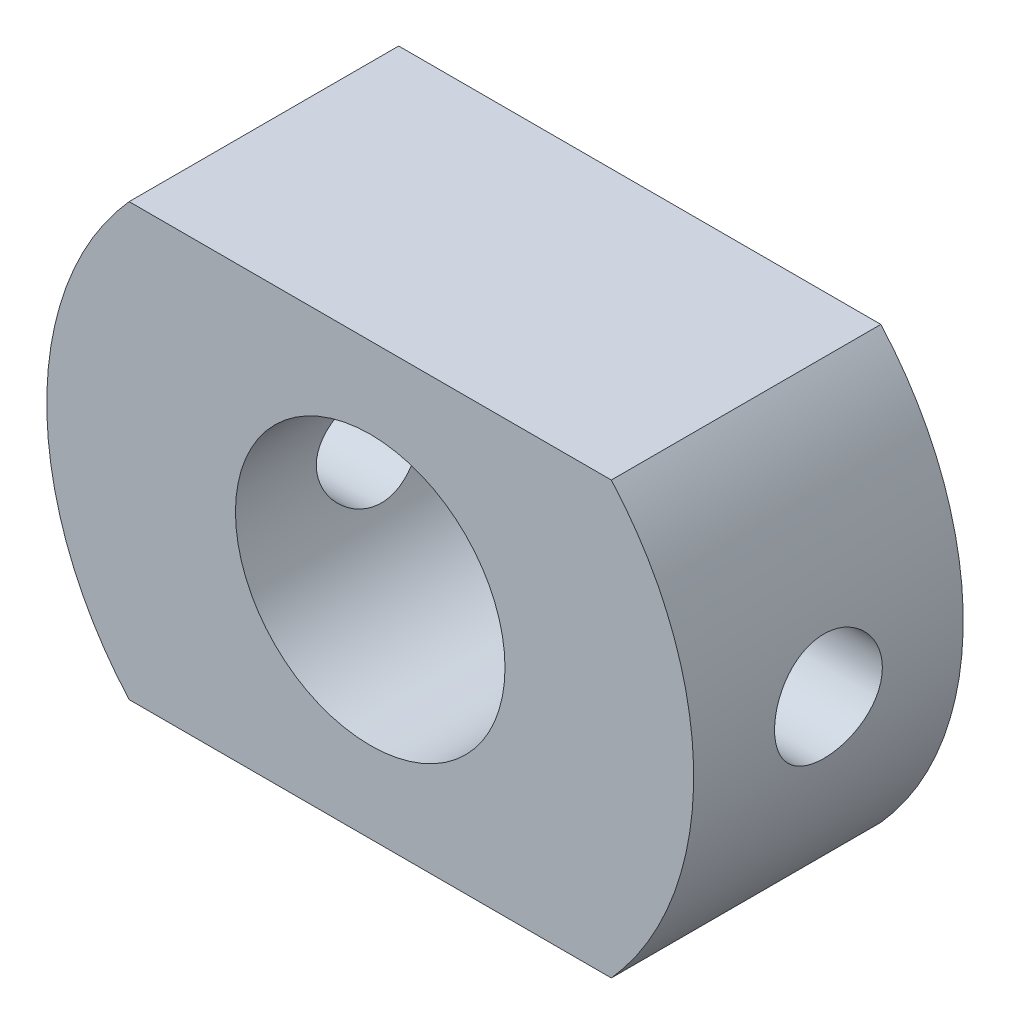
from build123d import *

# Parameters (mm, degrees)
ESQUISSE1_R                  = 2.5
BASE_EXTRUSION_DEPTH         = 5
ENL_V_MAT_EXTRU_1_DEPTH      = 9.774964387
ENL_V_MAT_EXTRU_1_DEPTH_BACK = 9.774964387
ESQUISSE2_R                  = 1


with BuildPart() as part:
    # Esquisse1 → Base-Extrusion (new body)
    with BuildSketch(Plane.XY):
        with BuildLine():
            Line((-4.472135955, 4), (4.472135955, 4))
            ThreePointArc((4.472135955, 4), (6, 0), (4.472135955, -4))
            Line((4.472135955, -4), (-4.472135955, -4))
            ThreePointArc((-4.472135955, -4), (-6, 0), (-4.472135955, 4))
        make_face()
        Circle(ESQUISSE1_R, mode=Mode.SUBTRACT)
    extrude(amount=BASE_EXTRUSION_DEPTH)

    # Esquisse2 → Enl_v. mat.-Extru.1 (cut, two sides: drawn at the far end of the back side and taken through both)
    with BuildSketch(Plane(origin=(0, 0, 0), x_dir=(0, 0, -1), z_dir=(1, 0, 0)).offset(-ENL_V_MAT_EXTRU_1_DEPTH_BACK)):
        with Locations((-2.5, 0)):
            Circle(ESQUISSE2_R)
    extrude(amount=ENL_V_MAT_EXTRU_1_DEPTH + ENL_V_MAT_EXTRU_1_DEPTH_BACK, mode=Mode.SUBTRACT)


solid = part.part
